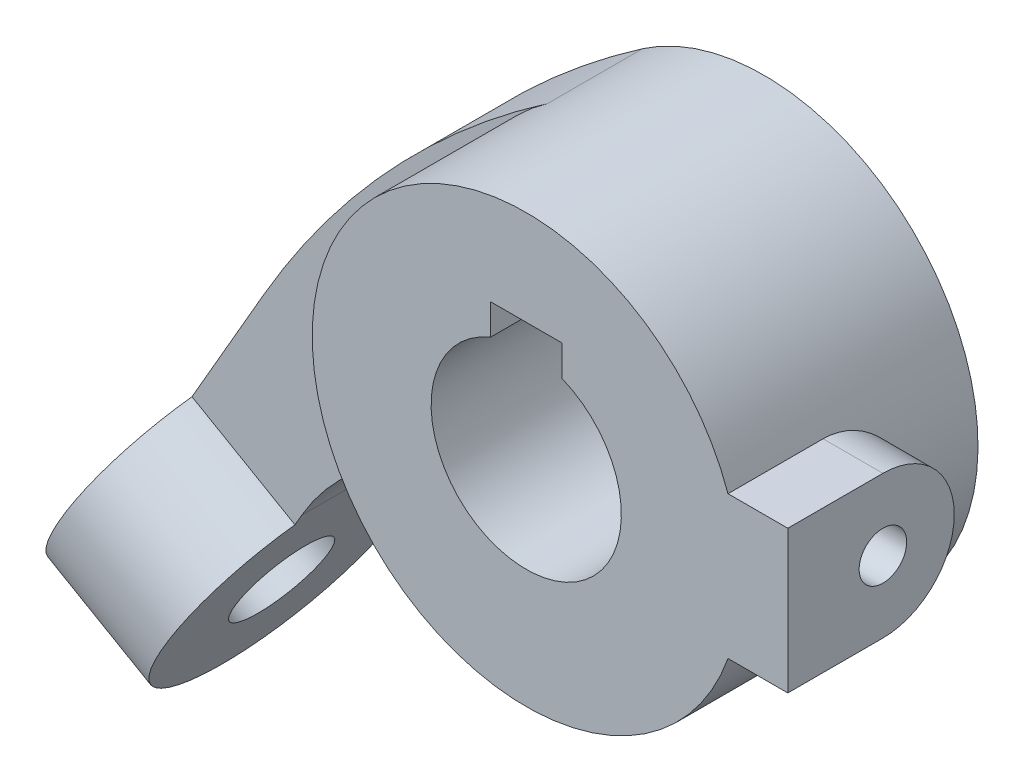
ISO-10303-21;
HEADER;
FILE_DESCRIPTION(('STEP AP214'),'2;1');
FILE_NAME('part.step','',(''),(''),'','','');
FILE_SCHEMA(('AUTOMOTIVE_DESIGN { 1 0 10303 214 1 1 1 1 }'));
ENDSEC;
DATA;
#1=APPLICATION_CONTEXT('core data for automotive mechanical design processes');
#2=APPLICATION_PROTOCOL_DEFINITION('international standard','automotive_design',2000,#1);
#3=PRODUCT_CONTEXT('',#1,'mechanical');
#4=PRODUCT('Part','Part','',(#3));
#5=PRODUCT_RELATED_PRODUCT_CATEGORY('part','',(#4));
#6=PRODUCT_DEFINITION_FORMATION('','',#4);
#7=PRODUCT_DEFINITION_CONTEXT('part definition',#1,'design');
#8=PRODUCT_DEFINITION('design','',#6,#7);
#9=PRODUCT_DEFINITION_SHAPE('','',#8);
#10=(LENGTH_UNIT() NAMED_UNIT(*) SI_UNIT(.MILLI.,.METRE.));
#11=(NAMED_UNIT(*) PLANE_ANGLE_UNIT() SI_UNIT($,.RADIAN.));
#12=(NAMED_UNIT(*) SI_UNIT($,.STERADIAN.) SOLID_ANGLE_UNIT());
#13=UNCERTAINTY_MEASURE_WITH_UNIT(LENGTH_MEASURE(1.E-05),#10,'distance_accuracy_value','');
#14=(GEOMETRIC_REPRESENTATION_CONTEXT(3) GLOBAL_UNCERTAINTY_ASSIGNED_CONTEXT((#13)) GLOBAL_UNIT_ASSIGNED_CONTEXT((#10,
#11,#12)) REPRESENTATION_CONTEXT('',''));
#15=CARTESIAN_POINT('',(0.,0.,0.));
#16=DIRECTION('',(0.,0.,1.));
#17=DIRECTION('',(1.,0.,0.));
#18=AXIS2_PLACEMENT_3D('',#15,#16,#17);
#19=CARTESIAN_POINT('',(0.,0.,20.));
#20=DIRECTION('',(0.,0.,-1.));
#21=DIRECTION('',(-1.,0.,0.));
#22=AXIS2_PLACEMENT_3D('',#19,#20,#21);
#23=CYLINDRICAL_SURFACE('',#22,18.);
#24=CARTESIAN_POINT('',(0.,0.,20.));
#25=DIRECTION('',(0.,0.,1.));
#26=DIRECTION('',(1.,0.,0.));
#27=AXIS2_PLACEMENT_3D('',#24,#25,#26);
#28=CIRCLE('',#27,18.);
#29=CARTESIAN_POINT('',(16.9705627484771,6.,20.));
#30=VERTEX_POINT('',#29);
#31=CARTESIAN_POINT('',(16.9705627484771,-6.,20.));
#32=VERTEX_POINT('',#31);
#33=EDGE_CURVE('E227',#30,#32,#28,.T.);
#34=ORIENTED_EDGE('',*,*,#33,.F.);
#35=DIRECTION('',(0.,0.,-1.));
#36=VECTOR('',#35,1.);
#37=CARTESIAN_POINT('',(16.9705627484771,6.,20.));
#38=LINE('',#37,#36);
#39=CARTESIAN_POINT('',(16.9705627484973,6.,12.));
#40=VERTEX_POINT('',#39);
#41=EDGE_CURVE('E173',#40,#30,#38,.F.);
#42=ORIENTED_EDGE('',*,*,#41,.F.);
#43=CARTESIAN_POINT('',(16.9705627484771,-6.,12.));
#44=CARTESIAN_POINT('',(16.9705358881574,-6.00002327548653,11.8363059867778));
#45=CARTESIAN_POINT('',(16.9729302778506,-5.99330214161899,11.6726221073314));
#46=CARTESIAN_POINT('',(16.9823649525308,-5.96654425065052,11.3465240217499));
#47=CARTESIAN_POINT('',(16.9894039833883,-5.94651108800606,11.1841094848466));
#48=CARTESIAN_POINT('',(17.0079041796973,-5.89338071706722,10.8621857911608));
#49=CARTESIAN_POINT('',(17.0193522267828,-5.86032225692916,10.7026694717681));
#50=CARTESIAN_POINT('',(17.0463054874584,-5.78145443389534,10.3871697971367));
#51=CARTESIAN_POINT('',(17.0618108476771,-5.73564461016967,10.231186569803));
#52=CARTESIAN_POINT('',(17.096396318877,-5.63171582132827,9.92393152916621));
#53=CARTESIAN_POINT('',(17.1154735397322,-5.57360680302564,9.77265602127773));
#54=CARTESIAN_POINT('',(17.1566605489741,-5.44550500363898,9.47558904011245));
#55=CARTESIAN_POINT('',(17.1787714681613,-5.37550778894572,9.32979963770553));
#56=CARTESIAN_POINT('',(17.2254031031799,-5.22415126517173,9.04461346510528));
#57=CARTESIAN_POINT('',(17.2499242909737,-5.14278972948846,8.90521795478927));
#58=CARTESIAN_POINT('',(17.3007173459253,-4.9692408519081,8.63360277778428));
#59=CARTESIAN_POINT('',(17.326989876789,-4.8770493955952,8.50138586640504));
#60=CARTESIAN_POINT('',(17.3815260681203,-4.67904463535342,8.24043953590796));
#61=CARTESIAN_POINT('',(17.4098272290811,-4.57286774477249,8.11199371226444));
#62=CARTESIAN_POINT('',(17.4667935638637,-4.35021031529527,7.86437382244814));
#63=CARTESIAN_POINT('',(17.49545886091,-4.23372620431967,7.74520299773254));
#64=CARTESIAN_POINT('',(17.5523750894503,-3.99119540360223,7.51691026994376));
#65=CARTESIAN_POINT('',(17.5806260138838,-3.86514855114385,7.40778853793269));
#66=CARTESIAN_POINT('',(17.6359611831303,-3.60425478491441,7.20029931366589));
#67=CARTESIAN_POINT('',(17.6630454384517,-3.46940795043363,7.1019317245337));
#68=CARTESIAN_POINT('',(17.716017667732,-3.1880620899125,6.91417565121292));
#69=CARTESIAN_POINT('',(17.7418552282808,-3.04134950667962,6.82509253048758));
#70=CARTESIAN_POINT('',(17.790803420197,-2.74053335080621,6.65968846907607));
#71=CARTESIAN_POINT('',(17.8139150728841,-2.5864325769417,6.58336274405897));
#72=CARTESIAN_POINT('',(17.8567641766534,-2.27182245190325,6.44406426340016));
#73=CARTESIAN_POINT('',(17.8765010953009,-2.11131209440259,6.38109361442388));
#74=CARTESIAN_POINT('',(17.9120119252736,-1.78513959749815,6.26911941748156));
#75=CARTESIAN_POINT('',(17.9277876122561,-1.61947980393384,6.22010961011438));
#76=CARTESIAN_POINT('',(17.9544516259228,-1.28997729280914,6.13793631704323));
#77=CARTESIAN_POINT('',(17.9654893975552,-1.12626807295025,6.10428575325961));
#78=CARTESIAN_POINT('',(17.9831292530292,-0.796442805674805,6.05074979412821));
#79=CARTESIAN_POINT('',(17.9897331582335,-0.630327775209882,6.03085874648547));
#80=CARTESIAN_POINT('',(17.9983239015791,-0.296898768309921,6.00501776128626));
#81=CARTESIAN_POINT('',(18.0003107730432,-0.129584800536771,5.99906772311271));
#82=CARTESIAN_POINT('',(17.999610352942,0.204943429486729,6.00116890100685));
#83=CARTESIAN_POINT('',(17.9969231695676,0.372157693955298,6.00921979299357));
#84=CARTESIAN_POINT('',(17.987149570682,0.698613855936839,6.038646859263));
#85=CARTESIAN_POINT('',(17.9802409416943,0.857909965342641,6.05948465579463));
#86=CARTESIAN_POINT('',(17.9623622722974,1.17415159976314,6.1138198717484));
#87=CARTESIAN_POINT('',(17.9513908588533,1.33109631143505,6.14732157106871));
#88=CARTESIAN_POINT('',(17.9256761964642,1.64145470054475,6.22667565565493));
#89=CARTESIAN_POINT('',(17.9109342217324,1.79486955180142,6.27252386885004));
#90=CARTESIAN_POINT('',(17.8780472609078,2.09727695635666,6.37621207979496));
#91=CARTESIAN_POINT('',(17.8599009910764,2.24626781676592,6.4340566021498));
#92=CARTESIAN_POINT('',(17.8204139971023,2.54070679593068,6.56208597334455));
#93=CARTESIAN_POINT('',(17.7990354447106,2.686085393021,6.632418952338));
#94=CARTESIAN_POINT('',(17.753792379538,2.97045362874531,6.78440731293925));
#95=CARTESIAN_POINT('',(17.7299270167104,3.10944105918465,6.86606656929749));
#96=CARTESIAN_POINT('',(17.6803107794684,3.38017058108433,7.04012638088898));
#97=CARTESIAN_POINT('',(17.6545598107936,3.51191230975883,7.13252747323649));
#98=CARTESIAN_POINT('',(17.601809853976,3.767400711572,7.32747242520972));
#99=CARTESIAN_POINT('',(17.5748108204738,3.89114709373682,7.43001665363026));
#100=CARTESIAN_POINT('',(17.5189422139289,4.13559143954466,7.64969602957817));
#101=CARTESIAN_POINT('',(17.4900445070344,4.2558696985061,7.76729146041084));
#102=CARTESIAN_POINT('',(17.4324086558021,4.4861132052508,8.01214074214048));
#103=CARTESIAN_POINT('',(17.4036704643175,4.59608167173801,8.13939155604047));
#104=CARTESIAN_POINT('',(17.3471202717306,4.8051173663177,8.40289722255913));
#105=CARTESIAN_POINT('',(17.3193089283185,4.90417696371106,8.53915827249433));
#106=CARTESIAN_POINT('',(17.2654357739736,5.09059336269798,8.81971485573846));
#107=CARTESIAN_POINT('',(17.239373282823,5.17795472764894,8.96400722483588));
#108=CARTESIAN_POINT('',(17.1893738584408,5.34161618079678,9.26203101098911));
#109=CARTESIAN_POINT('',(17.1654753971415,5.41772728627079,9.41587280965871));
#110=CARTESIAN_POINT('',(17.1210224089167,5.556609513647,9.72985774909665));
#111=CARTESIAN_POINT('',(17.1004664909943,5.61938618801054,9.88999823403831));
#112=CARTESIAN_POINT('',(17.0633817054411,5.73100924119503,10.2153228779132));
#113=CARTESIAN_POINT('',(17.0468484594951,5.77987077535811,10.3805013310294));
#114=CARTESIAN_POINT('',(17.0183470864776,5.86325820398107,10.7147529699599));
#115=CARTESIAN_POINT('',(17.0063768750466,5.89779064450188,10.883824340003));
#116=CARTESIAN_POINT('',(16.9882040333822,5.94992929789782,11.2104634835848));
#117=CARTESIAN_POINT('',(16.9816058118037,5.96870055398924,11.3678241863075));
#118=CARTESIAN_POINT('',(16.9727764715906,5.99373749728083,11.6834525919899));
#119=CARTESIAN_POINT('',(16.9705397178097,6.00001932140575,11.8417188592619));
#120=CARTESIAN_POINT('',(16.9705627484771,6.,12.));
#121=B_SPLINE_CURVE_WITH_KNOTS('',3,(#43,#44,#45,#46,#47,#48,#49,#50,#51,#52,#53,#54,#55,#56,
#57,#58,#59,#60,#61,#62,#63,#64,#65,#66,#67,#68,#69,#70,#71,#72,#73,#74,#75,#76,#77,#78,#79,#80,
#81,#82,#83,#84,#85,#86,#87,#88,#89,#90,#91,#92,#93,#94,#95,#96,#97,#98,#99,#100,#101,#102,#103,
#104,#105,#106,#107,#108,#109,#110,#111,#112,#113,#114,#115,#116,#117,#118,#119,#120),
.UNSPECIFIED.,.F.,.F.,(4,2,2,2,2,2,2,2,2,2,2,2,2,2,2,2,2,2,2,2,2,2,2,2,2,2,2,2,2,2,2,2,2,2,2,2,
2,2,4),(0.,0.490910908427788,0.9816893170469,1.47101863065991,1.96036563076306,2.44931837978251,
2.93845388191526,3.42768535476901,3.91710329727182,4.42363425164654,4.93034144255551,
5.43705725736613,5.94376850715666,6.46384823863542,6.98373248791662,7.50369868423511,
8.02343138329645,8.52528690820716,9.02693615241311,9.52858177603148,10.0302157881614,
10.5120543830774,10.9940559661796,11.4758948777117,11.9579158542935,12.4460912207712,
12.9344340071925,13.4228012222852,13.9111862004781,14.4226273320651,14.9339082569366,
15.445544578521,15.9569807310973,16.4762155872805,16.9952338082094,17.5136845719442,
18.0318982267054,18.5071898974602,18.9818670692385),.UNSPECIFIED.);
#122=CARTESIAN_POINT('',(16.9705627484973,-6.,12.));
#123=VERTEX_POINT('',#122);
#124=EDGE_CURVE('E170',#123,#40,#121,.T.);
#125=ORIENTED_EDGE('',*,*,#124,.F.);
#126=DIRECTION('',(0.,0.,-1.));
#127=VECTOR('',#126,1.);
#128=CARTESIAN_POINT('',(16.9705627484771,-6.,20.));
#129=LINE('',#128,#127);
#130=EDGE_CURVE('E180',#32,#123,#129,.T.);
#131=ORIENTED_EDGE('',*,*,#130,.F.);
#132=EDGE_LOOP('',(#34,#42,#125,#131));
#133=FACE_BOUND('',#132,.T.);
#134=DIRECTION('',(0.,0.,-1.));
#135=VECTOR('',#134,1.);
#136=CARTESIAN_POINT('',(-10.2174061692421,14.819062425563,8.));
#137=LINE('',#136,#135);
#138=CARTESIAN_POINT('',(-10.2174061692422,14.819062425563,8.));
#139=VERTEX_POINT('',#138);
#140=CARTESIAN_POINT('',(-10.2174061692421,14.819062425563,0.));
#141=VERTEX_POINT('',#140);
#142=EDGE_CURVE('E228',#139,#141,#137,.T.);
#143=ORIENTED_EDGE('',*,*,#142,.F.);
#144=CARTESIAN_POINT('',(0.,0.,8.));
#145=DIRECTION('',(0.,0.,-1.));
#146=DIRECTION('',(1.,0.,0.));
#147=AXIS2_PLACEMENT_3D('',#144,#145,#146);
#148=CIRCLE('',#147,18.);
#149=CARTESIAN_POINT('',(-6.42576818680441,-16.8139675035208,8.));
#150=VERTEX_POINT('',#149);
#151=EDGE_CURVE('E162',#150,#139,#148,.T.);
#152=ORIENTED_EDGE('',*,*,#151,.F.);
#153=DIRECTION('',(0.,0.,-1.));
#154=VECTOR('',#153,1.);
#155=CARTESIAN_POINT('',(-6.42576818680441,-16.8139675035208,8.));
#156=LINE('',#155,#154);
#157=CARTESIAN_POINT('',(-6.42576818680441,-16.8139675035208,0.));
#158=VERTEX_POINT('',#157);
#159=EDGE_CURVE('E176',#150,#158,#156,.T.);
#160=ORIENTED_EDGE('',*,*,#159,.T.);
#161=CARTESIAN_POINT('',(0.,0.,0.));
#162=DIRECTION('',(0.,0.,1.));
#163=DIRECTION('',(1.,0.,0.));
#164=AXIS2_PLACEMENT_3D('',#161,#162,#163);
#165=CIRCLE('',#164,18.);
#166=EDGE_CURVE('E230',#158,#141,#165,.T.);
#167=ORIENTED_EDGE('',*,*,#166,.T.);
#168=EDGE_LOOP('',(#143,#152,#160,#167));
#169=FACE_BOUND('',#168,.T.);
#170=ADVANCED_FACE('F46',(#133,#169),#23,.T.);
#171=CARTESIAN_POINT('',(0.,0.,20.));
#172=DIRECTION('',(0.,0.,1.));
#173=DIRECTION('',(1.,0.,0.));
#174=AXIS2_PLACEMENT_3D('',#171,#172,#173);
#175=PLANE('',#174);
#176=ORIENTED_EDGE('',*,*,#33,.T.);
#177=DIRECTION('',(1.,0.,0.));
#178=VECTOR('',#177,1.);
#179=CARTESIAN_POINT('',(-500000.,-6.,20.));
#180=LINE('',#179,#178);
#181=CARTESIAN_POINT('',(22.,-6.,20.));
#182=VERTEX_POINT('',#181);
#183=EDGE_CURVE('E453',#32,#182,#180,.T.);
#184=ORIENTED_EDGE('',*,*,#183,.T.);
#185=DIRECTION('',(0.,-1.,0.));
#186=VECTOR('',#185,1.);
#187=CARTESIAN_POINT('',(22.,6.,20.));
#188=LINE('',#187,#186);
#189=CARTESIAN_POINT('',(22.,6.,20.));
#190=VERTEX_POINT('',#189);
#191=EDGE_CURVE('E460',#190,#182,#188,.T.);
#192=ORIENTED_EDGE('',*,*,#191,.F.);
#193=DIRECTION('',(1.,0.,0.));
#194=VECTOR('',#193,1.);
#195=CARTESIAN_POINT('',(-500000.,6.,20.));
#196=LINE('',#195,#194);
#197=EDGE_CURVE('E451',#30,#190,#196,.T.);
#198=ORIENTED_EDGE('',*,*,#197,.F.);
#199=EDGE_LOOP('',(#176,#184,#192,#198));
#200=FACE_BOUND('',#199,.T.);
#201=DIRECTION('',(0.,1.,0.));
#202=VECTOR('',#201,1.);
#203=CARTESIAN_POINT('',(3.,7.41619848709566,20.));
#204=LINE('',#203,#202);
#205=CARTESIAN_POINT('',(3.,7.41619848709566,20.));
#206=VERTEX_POINT('',#205);
#207=CARTESIAN_POINT('',(3.,10.,20.));
#208=VERTEX_POINT('',#207);
#209=EDGE_CURVE('E446',#206,#208,#204,.T.);
#210=ORIENTED_EDGE('',*,*,#209,.F.);
#211=CARTESIAN_POINT('',(0.,0.,20.));
#212=DIRECTION('',(0.,0.,1.));
#213=DIRECTION('',(1.,0.,0.));
#214=AXIS2_PLACEMENT_3D('',#211,#212,#213);
#215=CIRCLE('',#214,8.);
#216=CARTESIAN_POINT('',(-3.,7.41619848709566,20.));
#217=VERTEX_POINT('',#216);
#218=EDGE_CURVE('E431',#217,#206,#215,.T.);
#219=ORIENTED_EDGE('',*,*,#218,.F.);
#220=DIRECTION('',(0.,-1.,0.));
#221=VECTOR('',#220,1.);
#222=CARTESIAN_POINT('',(-3.,7.41619848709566,20.));
#223=LINE('',#222,#221);
#224=CARTESIAN_POINT('',(-3.,10.,20.));
#225=VERTEX_POINT('',#224);
#226=EDGE_CURVE('E427',#225,#217,#223,.T.);
#227=ORIENTED_EDGE('',*,*,#226,.F.);
#228=DIRECTION('',(-1.,0.,0.));
#229=VECTOR('',#228,1.);
#230=CARTESIAN_POINT('',(-3.,10.,20.));
#231=LINE('',#230,#229);
#232=EDGE_CURVE('E443',#208,#225,#231,.T.);
#233=ORIENTED_EDGE('',*,*,#232,.F.);
#234=EDGE_LOOP('',(#210,#219,#227,#233));
#235=FACE_BOUND('',#234,.T.);
#236=ADVANCED_FACE('F214',(#200,#235),#175,.T.);
#237=CARTESIAN_POINT('',(0.,0.,0.));
#238=DIRECTION('',(0.,0.,1.));
#239=DIRECTION('',(1.,0.,0.));
#240=AXIS2_PLACEMENT_3D('',#237,#238,#239);
#241=PLANE('',#240);
#242=DIRECTION('',(0.5,0.866025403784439,0.));
#243=VECTOR('',#242,1.);
#244=CARTESIAN_POINT('',(-30.8860186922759,-25.4961536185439,0.));
#245=LINE('',#244,#243);
#246=CARTESIAN_POINT('',(-31.6451254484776,-26.810965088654,0.));
#247=VERTEX_POINT('',#246);
#248=CARTESIAN_POINT('',(-30.8860186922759,-25.4961536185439,0.));
#249=VERTEX_POINT('',#248);
#250=EDGE_CURVE('E67',#247,#249,#245,.T.);
#251=ORIENTED_EDGE('',*,*,#250,.F.);
#252=DIRECTION('',(-0.866025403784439,0.5,0.));
#253=VECTOR('',#252,1.);
#254=CARTESIAN_POINT('',(-31.6451254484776,-26.810965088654,0.));
#255=LINE('',#254,#253);
#256=CARTESIAN_POINT('',(-40.305379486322,-21.810965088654,0.));
#257=VERTEX_POINT('',#256);
#258=EDGE_CURVE('E62',#247,#257,#255,.T.);
#259=ORIENTED_EDGE('',*,*,#258,.T.);
#260=DIRECTION('',(-0.5,-0.866025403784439,0.));
#261=VECTOR('',#260,1.);
#262=CARTESIAN_POINT('',(-34.0887443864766,-11.0434372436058,0.));
#263=LINE('',#262,#261);
#264=CARTESIAN_POINT('',(-34.0887443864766,-11.0434372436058,0.));
#265=VERTEX_POINT('',#264);
#266=EDGE_CURVE('E238',#265,#257,#263,.T.);
#267=ORIENTED_EDGE('',*,*,#266,.F.);
#268=CARTESIAN_POINT('',(35.1932879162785,-51.0434372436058,0.));
#269=DIRECTION('',(0.,0.,1.));
#270=DIRECTION('',(1.,0.,0.));
#271=AXIS2_PLACEMENT_3D('',#268,#269,#270);
#272=CIRCLE('',#271,80.);
#273=EDGE_CURVE('E169',#141,#265,#272,.T.);
#274=ORIENTED_EDGE('',*,*,#273,.F.);
#275=ORIENTED_EDGE('',*,*,#166,.F.);
#276=CARTESIAN_POINT('',(-13.5655106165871,-35.4961536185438,0.));
#277=DIRECTION('',(0.,0.,-1.));
#278=DIRECTION('',(1.,0.,0.));
#279=AXIS2_PLACEMENT_3D('',#276,#277,#278);
#280=CIRCLE('',#279,20.);
#281=EDGE_CURVE('E165',#249,#158,#280,.T.);
#282=ORIENTED_EDGE('',*,*,#281,.F.);
#283=EDGE_LOOP('',(#251,#259,#267,#274,#275,#282));
#284=FACE_BOUND('',#283,.T.);
#285=CARTESIAN_POINT('',(0.,0.,0.));
#286=DIRECTION('',(0.,0.,1.));
#287=DIRECTION('',(1.,0.,0.));
#288=AXIS2_PLACEMENT_3D('',#285,#286,#287);
#289=CIRCLE('',#288,8.);
#290=CARTESIAN_POINT('',(-3.,7.41619848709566,0.));
#291=VERTEX_POINT('',#290);
#292=CARTESIAN_POINT('',(3.,7.41619848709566,0.));
#293=VERTEX_POINT('',#292);
#294=EDGE_CURVE('E438',#291,#293,#289,.T.);
#295=ORIENTED_EDGE('',*,*,#294,.T.);
#296=DIRECTION('',(0.,1.,0.));
#297=VECTOR('',#296,1.);
#298=CARTESIAN_POINT('',(3.,7.41619848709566,0.));
#299=LINE('',#298,#297);
#300=CARTESIAN_POINT('',(3.,10.,0.));
#301=VERTEX_POINT('',#300);
#302=EDGE_CURVE('E435',#293,#301,#299,.T.);
#303=ORIENTED_EDGE('',*,*,#302,.T.);
#304=DIRECTION('',(-1.,0.,0.));
#305=VECTOR('',#304,1.);
#306=CARTESIAN_POINT('',(-3.,10.,0.));
#307=LINE('',#306,#305);
#308=CARTESIAN_POINT('',(-3.,10.,0.));
#309=VERTEX_POINT('',#308);
#310=EDGE_CURVE('E432',#301,#309,#307,.T.);
#311=ORIENTED_EDGE('',*,*,#310,.T.);
#312=DIRECTION('',(0.,-1.,0.));
#313=VECTOR('',#312,1.);
#314=CARTESIAN_POINT('',(-3.,7.41619848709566,0.));
#315=LINE('',#314,#313);
#316=EDGE_CURVE('E428',#309,#291,#315,.T.);
#317=ORIENTED_EDGE('',*,*,#316,.T.);
#318=EDGE_LOOP('',(#295,#303,#311,#317));
#319=FACE_BOUND('',#318,.T.);
#320=ADVANCED_FACE('F219',(#284,#319),#241,.F.);
#321=CARTESIAN_POINT('',(0.,0.,20.));
#322=DIRECTION('',(0.,0.,-1.));
#323=DIRECTION('',(-1.,0.,0.));
#324=AXIS2_PLACEMENT_3D('',#321,#322,#323);
#325=CYLINDRICAL_SURFACE('',#324,8.);
#326=ORIENTED_EDGE('',*,*,#294,.F.);
#327=DIRECTION('',(0.,0.,-1.));
#328=VECTOR('',#327,1.);
#329=CARTESIAN_POINT('',(-3.,7.41619848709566,20.));
#330=LINE('',#329,#328);
#331=EDGE_CURVE('E424',#217,#291,#330,.T.);
#332=ORIENTED_EDGE('',*,*,#331,.F.);
#333=ORIENTED_EDGE('',*,*,#218,.T.);
#334=DIRECTION('',(0.,0.,-1.));
#335=VECTOR('',#334,1.);
#336=CARTESIAN_POINT('',(3.,7.41619848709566,20.));
#337=LINE('',#336,#335);
#338=EDGE_CURVE('E416',#206,#293,#337,.T.);
#339=ORIENTED_EDGE('',*,*,#338,.T.);
#340=EDGE_LOOP('',(#326,#332,#333,#339));
#341=FACE_BOUND('',#340,.T.);
#342=ADVANCED_FACE('F324',(#341),#325,.F.);
#343=CARTESIAN_POINT('',(3.,7.41619848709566,20.));
#344=DIRECTION('',(-1.,0.,0.));
#345=DIRECTION('',(0.,0.,1.));
#346=AXIS2_PLACEMENT_3D('',#343,#344,#345);
#347=PLANE('',#346);
#348=ORIENTED_EDGE('',*,*,#302,.F.);
#349=ORIENTED_EDGE('',*,*,#338,.F.);
#350=ORIENTED_EDGE('',*,*,#209,.T.);
#351=DIRECTION('',(0.,0.,-1.));
#352=VECTOR('',#351,1.);
#353=CARTESIAN_POINT('',(3.,10.,20.));
#354=LINE('',#353,#352);
#355=EDGE_CURVE('E420',#208,#301,#354,.T.);
#356=ORIENTED_EDGE('',*,*,#355,.T.);
#357=EDGE_LOOP('',(#348,#349,#350,#356));
#358=FACE_BOUND('',#357,.T.);
#359=ADVANCED_FACE('F336',(#358),#347,.T.);
#360=CARTESIAN_POINT('',(-3.,10.,20.));
#361=DIRECTION('',(0.,-1.,0.));
#362=DIRECTION('',(0.,0.,-1.));
#363=AXIS2_PLACEMENT_3D('',#360,#361,#362);
#364=PLANE('',#363);
#365=ORIENTED_EDGE('',*,*,#310,.F.);
#366=ORIENTED_EDGE('',*,*,#355,.F.);
#367=ORIENTED_EDGE('',*,*,#232,.T.);
#368=DIRECTION('',(0.,0.,-1.));
#369=VECTOR('',#368,1.);
#370=CARTESIAN_POINT('',(-3.,10.,20.));
#371=LINE('',#370,#369);
#372=EDGE_CURVE('E422',#225,#309,#371,.T.);
#373=ORIENTED_EDGE('',*,*,#372,.T.);
#374=EDGE_LOOP('',(#365,#366,#367,#373));
#375=FACE_BOUND('',#374,.T.);
#376=ADVANCED_FACE('F206',(#375),#364,.T.);
#377=CARTESIAN_POINT('',(-3.,7.41619848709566,20.));
#378=DIRECTION('',(1.,0.,0.));
#379=DIRECTION('',(0.,1.,0.));
#380=AXIS2_PLACEMENT_3D('',#377,#378,#379);
#381=PLANE('',#380);
#382=ORIENTED_EDGE('',*,*,#316,.F.);
#383=ORIENTED_EDGE('',*,*,#372,.F.);
#384=ORIENTED_EDGE('',*,*,#226,.T.);
#385=ORIENTED_EDGE('',*,*,#331,.T.);
#386=EDGE_LOOP('',(#382,#383,#384,#385));
#387=FACE_BOUND('',#386,.T.);
#388=ADVANCED_FACE('F198',(#387),#381,.T.);
#389=CARTESIAN_POINT('',(-500000.,6.,12.));
#390=DIRECTION('',(0.,1.,0.));
#391=DIRECTION('',(0.,0.,1.));
#392=AXIS2_PLACEMENT_3D('',#389,#390,#391);
#393=PLANE('',#392);
#394=DIRECTION('',(1.,0.,0.));
#395=VECTOR('',#394,1.);
#396=CARTESIAN_POINT('',(-500000.,6.,12.));
#397=LINE('',#396,#395);
#398=CARTESIAN_POINT('',(22.,6.,12.));
#399=VERTEX_POINT('',#398);
#400=EDGE_CURVE('E449',#40,#399,#397,.T.);
#401=ORIENTED_EDGE('',*,*,#400,.F.);
#402=ORIENTED_EDGE('',*,*,#41,.T.);
#403=ORIENTED_EDGE('',*,*,#197,.T.);
#404=DIRECTION('',(0.,0.,1.));
#405=VECTOR('',#404,1.);
#406=CARTESIAN_POINT('',(22.,6.,12.));
#407=LINE('',#406,#405);
#408=EDGE_CURVE('E463',#399,#190,#407,.T.);
#409=ORIENTED_EDGE('',*,*,#408,.F.);
#410=EDGE_LOOP('',(#401,#402,#403,#409));
#411=FACE_BOUND('',#410,.T.);
#412=ADVANCED_FACE('F196',(#411),#393,.T.);
#413=CARTESIAN_POINT('',(22.,0.,12.));
#414=DIRECTION('',(1.,0.,0.));
#415=DIRECTION('',(0.,0.,-1.));
#416=AXIS2_PLACEMENT_3D('',#413,#414,#415);
#417=PLANE('',#416);
#418=CARTESIAN_POINT('',(22.,0.,12.));
#419=DIRECTION('',(1.,0.,0.));
#420=DIRECTION('',(0.,0.,-1.));
#421=AXIS2_PLACEMENT_3D('',#418,#419,#420);
#422=CIRCLE('',#421,2.);
#423=CARTESIAN_POINT('',(22.,0.,10.));
#424=VERTEX_POINT('',#423);
#425=EDGE_CURVE('E457',#424,#424,#422,.T.);
#426=ORIENTED_EDGE('',*,*,#425,.F.);
#427=EDGE_LOOP('',(#426));
#428=FACE_BOUND('',#427,.T.);
#429=CARTESIAN_POINT('',(22.,0.,12.));
#430=DIRECTION('',(1.,0.,0.));
#431=DIRECTION('',(0.,0.,-1.));
#432=AXIS2_PLACEMENT_3D('',#429,#430,#431);
#433=CIRCLE('',#432,6.);
#434=CARTESIAN_POINT('',(22.,-6.,12.));
#435=VERTEX_POINT('',#434);
#436=EDGE_CURVE('E441',#435,#399,#433,.T.);
#437=ORIENTED_EDGE('',*,*,#436,.T.);
#438=ORIENTED_EDGE('',*,*,#408,.T.);
#439=ORIENTED_EDGE('',*,*,#191,.T.);
#440=DIRECTION('',(0.,0.,-1.));
#441=VECTOR('',#440,1.);
#442=CARTESIAN_POINT('',(22.,-6.,12.));
#443=LINE('',#442,#441);
#444=EDGE_CURVE('E459',#182,#435,#443,.T.);
#445=ORIENTED_EDGE('',*,*,#444,.T.);
#446=EDGE_LOOP('',(#437,#438,#439,#445));
#447=FACE_BOUND('',#446,.T.);
#448=ADVANCED_FACE('F194',(#428,#447),#417,.T.);
#449=CARTESIAN_POINT('',(-500000.,0.,12.));
#450=DIRECTION('',(1.,0.,0.));
#451=DIRECTION('',(0.,0.,-1.));
#452=AXIS2_PLACEMENT_3D('',#449,#450,#451);
#453=CYLINDRICAL_SURFACE('',#452,6.);
#454=DIRECTION('',(1.,0.,0.));
#455=VECTOR('',#454,1.);
#456=CARTESIAN_POINT('',(-500000.,-6.,12.));
#457=LINE('',#456,#455);
#458=EDGE_CURVE('E455',#123,#435,#457,.T.);
#459=ORIENTED_EDGE('',*,*,#458,.F.);
#460=ORIENTED_EDGE('',*,*,#124,.T.);
#461=ORIENTED_EDGE('',*,*,#400,.T.);
#462=ORIENTED_EDGE('',*,*,#436,.F.);
#463=EDGE_LOOP('',(#459,#460,#461,#462));
#464=FACE_BOUND('',#463,.T.);
#465=ADVANCED_FACE('F188',(#464),#453,.T.);
#466=CARTESIAN_POINT('',(-500000.,-6.,12.));
#467=DIRECTION('',(0.,-1.,0.));
#468=DIRECTION('',(0.,0.,-1.));
#469=AXIS2_PLACEMENT_3D('',#466,#467,#468);
#470=PLANE('',#469);
#471=ORIENTED_EDGE('',*,*,#183,.F.);
#472=ORIENTED_EDGE('',*,*,#130,.T.);
#473=ORIENTED_EDGE('',*,*,#458,.T.);
#474=ORIENTED_EDGE('',*,*,#444,.F.);
#475=EDGE_LOOP('',(#471,#472,#473,#474));
#476=FACE_BOUND('',#475,.T.);
#477=ADVANCED_FACE('F381',(#476),#470,.T.);
#478=CARTESIAN_POINT('',(-500000.,0.,12.));
#479=DIRECTION('',(1.,0.,0.));
#480=DIRECTION('',(0.,0.,-1.));
#481=AXIS2_PLACEMENT_3D('',#478,#479,#480);
#482=CYLINDRICAL_SURFACE('',#481,2.);
#483=ORIENTED_EDGE('',*,*,#425,.T.);
#484=EDGE_LOOP('',(#483));
#485=FACE_BOUND('',#484,.T.);
#486=CARTESIAN_POINT('',(18.,0.,10.));
#487=CARTESIAN_POINT('',(17.9999985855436,-0.111970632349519,10.0000048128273));
#488=CARTESIAN_POINT('',(17.9989441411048,-0.22401360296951,10.0094347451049));
#489=CARTESIAN_POINT('',(17.9948391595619,-0.444988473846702,10.0469075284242));
#490=CARTESIAN_POINT('',(17.9917864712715,-0.553916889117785,10.0749704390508));
#491=CARTESIAN_POINT('',(17.9840293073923,-0.76543107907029,10.1488779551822));
#492=CARTESIAN_POINT('',(17.9793258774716,-0.868020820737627,10.1947113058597));
#493=CARTESIAN_POINT('',(17.9687919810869,-1.06403053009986,10.3028356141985));
#494=CARTESIAN_POINT('',(17.9629617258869,-1.1574522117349,10.3651234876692));
#495=CARTESIAN_POINT('',(17.9507977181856,-1.33290575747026,10.5046820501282));
#496=CARTESIAN_POINT('',(17.9444620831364,-1.4148915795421,10.5820104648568));
#497=CARTESIAN_POINT('',(17.9320167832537,-1.5647500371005,10.7493314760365));
#498=CARTESIAN_POINT('',(17.9259071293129,-1.63262199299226,10.8393246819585));
#499=CARTESIAN_POINT('',(17.9145866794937,-1.7524930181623,11.0297139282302));
#500=CARTESIAN_POINT('',(17.9093782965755,-1.80444975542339,11.1301367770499));
#501=CARTESIAN_POINT('',(17.9004741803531,-1.89074517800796,11.3383494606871));
#502=CARTESIAN_POINT('',(17.8967784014,-1.92508439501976,11.446139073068));
#503=CARTESIAN_POINT('',(17.8913354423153,-1.97503194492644,11.6655519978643));
#504=CARTESIAN_POINT('',(17.8895802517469,-1.99071729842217,11.7771575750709));
#505=CARTESIAN_POINT('',(17.8881925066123,-2.00315006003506,12.0014298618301));
#506=CARTESIAN_POINT('',(17.8885598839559,-1.99989807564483,12.1140965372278));
#507=CARTESIAN_POINT('',(17.891368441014,-1.97461184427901,12.3367594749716));
#508=CARTESIAN_POINT('',(17.8938003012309,-1.95266200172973,12.4467654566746));
#509=CARTESIAN_POINT('',(17.9004492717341,-1.89073461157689,12.6615226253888));
#510=CARTESIAN_POINT('',(17.904666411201,-1.85075676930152,12.7662737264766));
#511=CARTESIAN_POINT('',(17.9144214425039,-1.75381606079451,12.9678124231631));
#512=CARTESIAN_POINT('',(17.9199622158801,-1.6968160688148,13.0645820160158));
#513=CARTESIAN_POINT('',(17.9317378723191,-1.56747570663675,13.2472136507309));
#514=CARTESIAN_POINT('',(17.9379727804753,-1.49513478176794,13.3330752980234));
#515=CARTESIAN_POINT('',(17.9504756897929,-1.33669614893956,13.4919439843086));
#516=CARTESIAN_POINT('',(17.9567436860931,-1.25052560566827,13.5648784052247));
#517=CARTESIAN_POINT('',(17.9685745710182,-1.06712581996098,13.6952583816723));
#518=CARTESIAN_POINT('',(17.9741374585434,-0.969896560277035,13.7527039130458));
#519=CARTESIAN_POINT('',(17.9839338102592,-0.767086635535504,13.8504737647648));
#520=CARTESIAN_POINT('',(17.9881669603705,-0.661504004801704,13.8907940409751));
#521=CARTESIAN_POINT('',(17.9948238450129,-0.445009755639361,13.9531137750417));
#522=CARTESIAN_POINT('',(17.997247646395,-0.334098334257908,13.9751139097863));
#523=CARTESIAN_POINT('',(18.0000041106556,-0.110723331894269,14.0000759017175));
#524=CARTESIAN_POINT('',(18.0003477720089,0.00172892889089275,14.0031378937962));
#525=CARTESIAN_POINT('',(17.998934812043,0.225544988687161,13.9904002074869));
#526=CARTESIAN_POINT('',(17.9971782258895,0.33690880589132,13.9746008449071));
#527=CARTESIAN_POINT('',(17.9917690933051,0.555095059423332,13.9246720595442));
#528=CARTESIAN_POINT('',(17.9881214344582,0.661928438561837,13.8905898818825));
#529=CARTESIAN_POINT('',(17.9793390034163,0.868362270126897,13.8051117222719));
#530=CARTESIAN_POINT('',(17.9742041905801,0.967962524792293,13.753715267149));
#531=CARTESIAN_POINT('',(17.9629935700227,1.15755326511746,13.634821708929));
#532=CARTESIAN_POINT('',(17.9569139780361,1.24750253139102,13.5672592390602));
#533=CARTESIAN_POINT('',(17.9445071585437,1.41481983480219,13.4180447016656));
#534=CARTESIAN_POINT('',(17.938179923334,1.49218748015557,13.3363921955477));
#535=CARTESIAN_POINT('',(17.925957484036,1.63249622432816,13.1608767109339));
#536=CARTESIAN_POINT('',(17.920064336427,1.69537132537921,13.0669608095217));
#537=CARTESIAN_POINT('',(17.9094097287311,1.80445556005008,12.8698437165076));
#538=CARTESIAN_POINT('',(17.9046482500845,1.85066496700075,12.7666426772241));
#539=CARTESIAN_POINT('',(17.8968094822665,1.92499712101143,12.5541055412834));
#540=CARTESIAN_POINT('',(17.8937286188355,1.95315827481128,12.4447830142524));
#541=CARTESIAN_POINT('',(17.8895891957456,1.99071877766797,12.2229248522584));
#542=CARTESIAN_POINT('',(17.8885305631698,2.00011880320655,12.1103893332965));
#543=CARTESIAN_POINT('',(17.8885572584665,1.99987957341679,11.8859558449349));
#544=CARTESIAN_POINT('',(17.8896309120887,1.99034399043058,11.774057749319));
#545=CARTESIAN_POINT('',(17.8937762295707,1.9527225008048,11.5534642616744));
#546=CARTESIAN_POINT('',(17.8968478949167,1.92463658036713,11.4447688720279));
#547=CARTESIAN_POINT('',(17.9046397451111,1.85074191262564,11.2336724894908));
#548=CARTESIAN_POINT('',(17.9093595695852,1.80493703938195,11.1312701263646));
#549=CARTESIAN_POINT('',(17.9199166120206,1.69691508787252,10.9355895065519));
#550=CARTESIAN_POINT('',(17.9257538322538,1.63469797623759,10.842311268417));
#551=CARTESIAN_POINT('',(17.9379262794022,1.49522995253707,10.6669957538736));
#552=CARTESIAN_POINT('',(17.944263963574,1.41790170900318,10.5850201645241));
#553=CARTESIAN_POINT('',(17.9567010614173,1.25056419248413,10.4351661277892));
#554=CARTESIAN_POINT('',(17.962800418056,1.16055190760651,10.3672910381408));
#555=CARTESIAN_POINT('',(17.9740935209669,0.970094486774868,10.2473956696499));
#556=CARTESIAN_POINT('',(17.9792844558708,0.869618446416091,10.1954242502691));
#557=CARTESIAN_POINT('',(17.9881463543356,0.66136849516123,10.1091625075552));
#558=CARTESIAN_POINT('',(17.9918190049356,0.55360283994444,10.0748525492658));
#559=CARTESIAN_POINT('',(17.9963232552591,0.371040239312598,10.0333008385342));
#560=CARTESIAN_POINT('',(17.9976954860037,0.297404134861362,10.0208304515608));
#561=CARTESIAN_POINT('',(17.9995343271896,0.149189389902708,10.004178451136));
#562=CARTESIAN_POINT('',(18.000000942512,0.074610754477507,9.99999679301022));
#563=CARTESIAN_POINT('',(18.,0.,10.));
#564=B_SPLINE_CURVE_WITH_KNOTS('',3,(#486,#487,#488,#489,#490,#491,#492,#493,#494,#495,#496,
#497,#498,#499,#500,#501,#502,#503,#504,#505,#506,#507,#508,#509,#510,#511,#512,#513,#514,#515,
#516,#517,#518,#519,#520,#521,#522,#523,#524,#525,#526,#527,#528,#529,#530,#531,#532,#533,#534,
#535,#536,#537,#538,#539,#540,#541,#542,#543,#544,#545,#546,#547,#548,#549,#550,#551,#552,#553,
#554,#555,#556,#557,#558,#559,#560,#561,#562,#563),.UNSPECIFIED.,.T.,.F.,(4,2,2,2,2,2,2,2,2,2,2,
2,2,2,2,2,2,2,2,2,2,2,2,2,2,2,2,2,2,2,2,2,2,2,2,2,2,2,4),(0.,0.335639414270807,
0.671640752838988,1.00742963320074,1.34315561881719,1.68019649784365,2.01725360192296,
2.35519959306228,2.69313538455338,3.02967096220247,3.36619574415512,3.70120941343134,
4.03622855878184,4.37198379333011,4.70775116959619,5.0453487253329,5.3829468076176,
5.72062456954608,6.05828985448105,6.39416820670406,6.73004093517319,7.06504987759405,
7.40006797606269,7.73646430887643,8.07287111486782,8.41078088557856,8.74868511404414,
9.08586787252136,9.42303847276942,9.75836815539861,10.0936980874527,10.4289547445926,
10.7642120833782,11.1012322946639,11.4383326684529,11.7764585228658,12.1142076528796,
12.3378595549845,12.5615102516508),.UNSPECIFIED.);
#565=CARTESIAN_POINT('',(18.,0.,10.));
#566=VERTEX_POINT('',#565);
#567=EDGE_CURVE('E55',#566,#566,#564,.T.);
#568=ORIENTED_EDGE('',*,*,#567,.T.);
#569=EDGE_LOOP('',(#568));
#570=FACE_BOUND('',#569,.T.);
#571=ADVANCED_FACE('F209',(#485,#570),#482,.F.);
#572=ORIENTED_EDGE('',*,*,#567,.F.);
#573=EDGE_LOOP('',(#572));
#574=FACE_BOUND('',#573,.T.);
#575=ADVANCED_FACE('F200',(#574),#23,.T.);
#576=CARTESIAN_POINT('',(35.1932879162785,-51.0434372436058,8.));
#577=DIRECTION('',(0.,0.,-1.));
#578=DIRECTION('',(-1.,0.,0.));
#579=AXIS2_PLACEMENT_3D('',#576,#577,#578);
#580=CYLINDRICAL_SURFACE('',#579,80.);
#581=ORIENTED_EDGE('',*,*,#273,.T.);
#582=DIRECTION('',(0.,0.,-1.));
#583=VECTOR('',#582,1.);
#584=CARTESIAN_POINT('',(-34.0887443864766,-11.0434372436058,8.));
#585=LINE('',#584,#583);
#586=CARTESIAN_POINT('',(-34.0887443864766,-11.0434372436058,8.));
#587=VERTEX_POINT('',#586);
#588=EDGE_CURVE('E150',#587,#265,#585,.T.);
#589=ORIENTED_EDGE('',*,*,#588,.F.);
#590=CARTESIAN_POINT('',(35.1932879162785,-51.0434372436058,8.));
#591=DIRECTION('',(0.,0.,1.));
#592=DIRECTION('',(1.,0.,0.));
#593=AXIS2_PLACEMENT_3D('',#590,#591,#592);
#594=CIRCLE('',#593,80.);
#595=EDGE_CURVE('E156',#139,#587,#594,.T.);
#596=ORIENTED_EDGE('',*,*,#595,.F.);
#597=ORIENTED_EDGE('',*,*,#142,.T.);
#598=EDGE_LOOP('',(#581,#589,#596,#597));
#599=FACE_BOUND('',#598,.T.);
#600=ADVANCED_FACE('F167',(#599),#580,.T.);
#601=CARTESIAN_POINT('',(-34.0887443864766,-11.0434372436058,8.));
#602=DIRECTION('',(0.866025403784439,-0.5,0.));
#603=DIRECTION('',(0.5,0.866025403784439,0.));
#604=AXIS2_PLACEMENT_3D('',#601,#602,#603);
#605=PLANE('',#604);
#606=CARTESIAN_POINT('',(-44.7846096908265,-29.5692193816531,4.4436456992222));
#607=DIRECTION('',(-0.866025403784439,0.5,0.));
#608=DIRECTION('',(-0.5,-0.866025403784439,0.));
#609=AXIS2_PLACEMENT_3D('',#606,#607,#608);
#610=CIRCLE('',#609,4.);
#611=CARTESIAN_POINT('',(-46.7846096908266,-33.0333209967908,4.4436456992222));
#612=VERTEX_POINT('',#611);
#613=EDGE_CURVE('E248',#612,#612,#610,.T.);
#614=ORIENTED_EDGE('',*,*,#613,.F.);
#615=EDGE_LOOP('',(#614));
#616=FACE_BOUND('',#615,.T.);
#617=ORIENTED_EDGE('',*,*,#266,.T.);
#618=CARTESIAN_POINT('',(-44.7846096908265,-29.5692193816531,4.4436456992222));
#619=DIRECTION('',(-0.866025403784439,0.5,0.));
#620=DIRECTION('',(-0.5,-0.866025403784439,0.));
#621=AXIS2_PLACEMENT_3D('',#618,#619,#620);
#622=CIRCLE('',#621,10.);
#623=CARTESIAN_POINT('',(-40.1114858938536,-21.4751315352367,8.));
#624=VERTEX_POINT('',#623);
#625=EDGE_CURVE('E153',#257,#624,#622,.T.);
#626=ORIENTED_EDGE('',*,*,#625,.T.);
#627=DIRECTION('',(-0.5,-0.866025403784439,0.));
#628=VECTOR('',#627,1.);
#629=CARTESIAN_POINT('',(-34.0887443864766,-11.0434372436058,8.));
#630=LINE('',#629,#628);
#631=EDGE_CURVE('E146',#587,#624,#630,.T.);
#632=ORIENTED_EDGE('',*,*,#631,.F.);
#633=ORIENTED_EDGE('',*,*,#588,.T.);
#634=EDGE_LOOP('',(#617,#626,#632,#633));
#635=FACE_BOUND('',#634,.T.);
#636=ADVANCED_FACE('F148',(#616,#635),#605,.F.);
#637=CARTESIAN_POINT('',(-30.8860186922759,-25.4961536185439,8.));
#638=DIRECTION('',(-0.866025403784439,0.5,0.));
#639=DIRECTION('',(-0.5,-0.866025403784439,0.));
#640=AXIS2_PLACEMENT_3D('',#637,#638,#639);
#641=PLANE('',#640);
#642=CARTESIAN_POINT('',(-36.1243556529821,-34.5692193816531,4.4436456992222));
#643=DIRECTION('',(-0.866025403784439,0.5,0.));
#644=DIRECTION('',(-0.5,-0.866025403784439,0.));
#645=AXIS2_PLACEMENT_3D('',#642,#643,#644);
#646=CIRCLE('',#645,4.);
#647=CARTESIAN_POINT('',(-38.1243556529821,-38.0333209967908,4.4436456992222));
#648=VERTEX_POINT('',#647);
#649=EDGE_CURVE('E50',#648,#648,#646,.T.);
#650=ORIENTED_EDGE('',*,*,#649,.T.);
#651=EDGE_LOOP('',(#650));
#652=FACE_BOUND('',#651,.T.);
#653=CARTESIAN_POINT('',(-36.1243556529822,-34.5692193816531,4.4436456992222));
#654=DIRECTION('',(-0.866025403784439,0.5,0.));
#655=DIRECTION('',(-0.5,-0.866025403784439,0.));
#656=AXIS2_PLACEMENT_3D('',#653,#654,#655);
#657=CIRCLE('',#656,10.);
#658=CARTESIAN_POINT('',(-31.4512318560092,-26.4751315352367,8.));
#659=VERTEX_POINT('',#658);
#660=EDGE_CURVE('E244',#247,#659,#657,.T.);
#661=ORIENTED_EDGE('',*,*,#660,.F.);
#662=ORIENTED_EDGE('',*,*,#250,.T.);
#663=DIRECTION('',(0.,0.,-1.));
#664=VECTOR('',#663,1.);
#665=CARTESIAN_POINT('',(-30.8860186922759,-25.4961536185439,8.));
#666=LINE('',#665,#664);
#667=CARTESIAN_POINT('',(-30.8860186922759,-25.4961536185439,8.));
#668=VERTEX_POINT('',#667);
#669=EDGE_CURVE('E171',#668,#249,#666,.T.);
#670=ORIENTED_EDGE('',*,*,#669,.F.);
#671=DIRECTION('',(0.5,0.866025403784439,0.));
#672=VECTOR('',#671,1.);
#673=CARTESIAN_POINT('',(-30.8860186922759,-25.4961536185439,8.));
#674=LINE('',#673,#672);
#675=EDGE_CURVE('E155',#659,#668,#674,.T.);
#676=ORIENTED_EDGE('',*,*,#675,.F.);
#677=EDGE_LOOP('',(#661,#662,#670,#676));
#678=FACE_BOUND('',#677,.T.);
#679=ADVANCED_FACE('F255',(#652,#678),#641,.F.);
#680=CARTESIAN_POINT('',(-13.5655106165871,-35.4961536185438,8.));
#681=DIRECTION('',(0.,0.,-1.));
#682=DIRECTION('',(-1.,0.,0.));
#683=AXIS2_PLACEMENT_3D('',#680,#681,#682);
#684=CYLINDRICAL_SURFACE('',#683,20.);
#685=ORIENTED_EDGE('',*,*,#281,.T.);
#686=ORIENTED_EDGE('',*,*,#159,.F.);
#687=CARTESIAN_POINT('',(-13.5655106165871,-35.4961536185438,8.));
#688=DIRECTION('',(0.,0.,-1.));
#689=DIRECTION('',(1.,0.,0.));
#690=AXIS2_PLACEMENT_3D('',#687,#688,#689);
#691=CIRCLE('',#690,20.);
#692=EDGE_CURVE('E232',#668,#150,#691,.T.);
#693=ORIENTED_EDGE('',*,*,#692,.F.);
#694=ORIENTED_EDGE('',*,*,#669,.T.);
#695=EDGE_LOOP('',(#685,#686,#693,#694));
#696=FACE_BOUND('',#695,.T.);
#697=ADVANCED_FACE('F270',(#696),#684,.F.);
#698=CARTESIAN_POINT('',(35.1932879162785,-51.0434372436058,8.));
#699=DIRECTION('',(0.,0.,1.));
#700=DIRECTION('',(1.,0.,0.));
#701=AXIS2_PLACEMENT_3D('',#698,#699,#700);
#702=PLANE('',#701);
#703=DIRECTION('',(-0.866025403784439,0.5,0.));
#704=VECTOR('',#703,1.);
#705=CARTESIAN_POINT('',(-31.4512318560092,-26.4751315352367,8.));
#706=LINE('',#705,#704);
#707=EDGE_CURVE('E12',#659,#624,#706,.T.);
#708=ORIENTED_EDGE('',*,*,#707,.F.);
#709=ORIENTED_EDGE('',*,*,#675,.T.);
#710=ORIENTED_EDGE('',*,*,#692,.T.);
#711=ORIENTED_EDGE('',*,*,#151,.T.);
#712=ORIENTED_EDGE('',*,*,#595,.T.);
#713=ORIENTED_EDGE('',*,*,#631,.T.);
#714=EDGE_LOOP('',(#708,#709,#710,#711,#712,#713));
#715=FACE_BOUND('',#714,.T.);
#716=ADVANCED_FACE('F160',(#715),#702,.T.);
#717=CARTESIAN_POINT('',(-36.1243556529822,-34.5692193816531,4.4436456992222));
#718=DIRECTION('',(-0.866025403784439,0.5,0.));
#719=DIRECTION('',(-0.5,-0.866025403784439,0.));
#720=AXIS2_PLACEMENT_3D('',#717,#718,#719);
#721=CYLINDRICAL_SURFACE('',#720,10.);
#722=ORIENTED_EDGE('',*,*,#258,.F.);
#723=ORIENTED_EDGE('',*,*,#660,.T.);
#724=ORIENTED_EDGE('',*,*,#707,.T.);
#725=ORIENTED_EDGE('',*,*,#625,.F.);
#726=EDGE_LOOP('',(#722,#723,#724,#725));
#727=FACE_BOUND('',#726,.T.);
#728=ADVANCED_FACE('F260',(#727),#721,.T.);
#729=CARTESIAN_POINT('',(-35.2583302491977,-35.0692193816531,4.4436456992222));
#730=DIRECTION('',(-0.866025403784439,0.5,0.));
#731=DIRECTION('',(-0.5,-0.866025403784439,0.));
#732=AXIS2_PLACEMENT_3D('',#729,#730,#731);
#733=CYLINDRICAL_SURFACE('',#732,4.);
#734=ORIENTED_EDGE('',*,*,#613,.T.);
#735=EDGE_LOOP('',(#734));
#736=FACE_BOUND('',#735,.T.);
#737=ORIENTED_EDGE('',*,*,#649,.F.);
#738=EDGE_LOOP('',(#737));
#739=FACE_BOUND('',#738,.T.);
#740=ADVANCED_FACE('F258',(#736,#739),#733,.F.);
#741=CLOSED_SHELL('',(#170,#236,#320,#342,#359,#376,#388,#412,#448,#465,#477,#571,#575,#600,
#636,#679,#697,#716,#728,#740));
#742=MANIFOLD_SOLID_BREP('B2',#741);
#743=ADVANCED_BREP_SHAPE_REPRESENTATION('',(#18,#742),#14);
#744=SHAPE_DEFINITION_REPRESENTATION(#9,#743);
ENDSEC;
END-ISO-10303-21;
